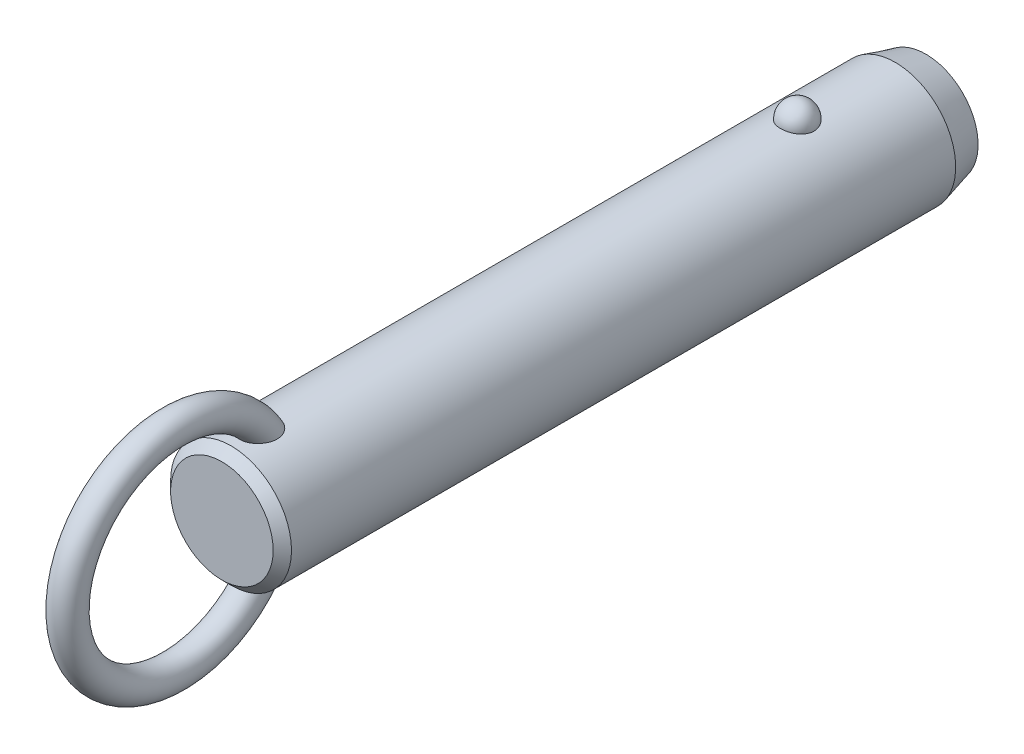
ISO-10303-21;
HEADER;
FILE_DESCRIPTION(('STEP AP214'),'2;1');
FILE_NAME('part.step','',(''),(''),'','','');
FILE_SCHEMA(('AUTOMOTIVE_DESIGN { 1 0 10303 214 1 1 1 1 }'));
ENDSEC;
DATA;
#1=APPLICATION_CONTEXT('core data for automotive mechanical design processes');
#2=APPLICATION_PROTOCOL_DEFINITION('international standard','automotive_design',2000,#1);
#3=PRODUCT_CONTEXT('',#1,'mechanical');
#4=PRODUCT('Part','Part','',(#3));
#5=PRODUCT_RELATED_PRODUCT_CATEGORY('part','',(#4));
#6=PRODUCT_DEFINITION_FORMATION('','',#4);
#7=PRODUCT_DEFINITION_CONTEXT('part definition',#1,'design');
#8=PRODUCT_DEFINITION('design','',#6,#7);
#9=PRODUCT_DEFINITION_SHAPE('','',#8);
#10=(LENGTH_UNIT() NAMED_UNIT(*) SI_UNIT(.MILLI.,.METRE.));
#11=(NAMED_UNIT(*) PLANE_ANGLE_UNIT() SI_UNIT($,.RADIAN.));
#12=(NAMED_UNIT(*) SI_UNIT($,.STERADIAN.) SOLID_ANGLE_UNIT());
#13=UNCERTAINTY_MEASURE_WITH_UNIT(LENGTH_MEASURE(1.E-05),#10,'distance_accuracy_value','');
#14=(GEOMETRIC_REPRESENTATION_CONTEXT(3) GLOBAL_UNCERTAINTY_ASSIGNED_CONTEXT((#13)) GLOBAL_UNIT_ASSIGNED_CONTEXT((#10,
#11,#12)) REPRESENTATION_CONTEXT('',''));
#15=CARTESIAN_POINT('',(0.,0.,0.));
#16=DIRECTION('',(0.,0.,1.));
#17=DIRECTION('',(1.,0.,0.));
#18=AXIS2_PLACEMENT_3D('',#15,#16,#17);
#19=CARTESIAN_POINT('',(0.,0.,63.5));
#20=DIRECTION('',(0.,0.,-1.));
#21=DIRECTION('',(-1.,0.,0.));
#22=AXIS2_PLACEMENT_3D('',#19,#20,#21);
#23=CYLINDRICAL_SURFACE('',#22,7.9);
#24=CARTESIAN_POINT('',(2.1785689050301,7.59367088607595,-2.19999999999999));
#25=CARTESIAN_POINT('',(2.17856679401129,7.59367269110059,-2.07701843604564));
#26=CARTESIAN_POINT('',(2.16853481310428,7.59657145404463,-1.95401006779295));
#27=CARTESIAN_POINT('',(2.12864689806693,7.607843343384,-1.71147811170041));
#28=CARTESIAN_POINT('',(2.09878338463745,7.61621856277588,-1.59195587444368));
#29=CARTESIAN_POINT('',(2.0199931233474,7.63749180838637,-1.3598563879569));
#30=CARTESIAN_POINT('',(1.97107475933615,7.6503878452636,-1.24727610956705));
#31=CARTESIAN_POINT('',(1.85539377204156,7.67926115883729,-1.03213234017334));
#32=CARTESIAN_POINT('',(1.78863158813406,7.69523835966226,-0.929568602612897));
#33=CARTESIAN_POINT('',(1.63856494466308,7.7285848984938,-0.736786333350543));
#34=CARTESIAN_POINT('',(1.55518140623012,7.7459606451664,-0.646630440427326));
#35=CARTESIAN_POINT('',(1.37422937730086,7.78009978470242,-0.481747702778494));
#36=CARTESIAN_POINT('',(1.27666086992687,7.79686317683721,-0.407020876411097));
#37=CARTESIAN_POINT('',(1.07024728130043,7.82786153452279,-0.275278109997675));
#38=CARTESIAN_POINT('',(0.961434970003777,7.84210353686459,-0.218212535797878));
#39=CARTESIAN_POINT('',(0.735351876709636,7.86652194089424,-0.123146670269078));
#40=CARTESIAN_POINT('',(0.618082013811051,7.87669878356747,-0.085144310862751));
#41=CARTESIAN_POINT('',(0.380637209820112,7.89170521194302,-0.0298158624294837));
#42=CARTESIAN_POINT('',(0.260550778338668,7.89662650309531,-0.0121347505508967));
#43=CARTESIAN_POINT('',(0.0190117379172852,7.90090003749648,0.00324379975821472));
#44=CARTESIAN_POINT('',(-0.102440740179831,7.90025280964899,0.00094313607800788));
#45=CARTESIAN_POINT('',(-0.341452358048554,7.89351056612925,-0.0233955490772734));
#46=CARTESIAN_POINT('',(-0.459042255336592,7.88749257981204,-0.0451545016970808));
#47=CARTESIAN_POINT('',(-0.688796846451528,7.87075812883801,-0.107408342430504));
#48=CARTESIAN_POINT('',(-0.800961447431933,7.86004158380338,-0.147903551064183));
#49=CARTESIAN_POINT('',(-1.01743634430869,7.83497131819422,-0.246799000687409));
#50=CARTESIAN_POINT('',(-1.12169791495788,7.82059709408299,-0.305300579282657));
#51=CARTESIAN_POINT('',(-1.31891765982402,7.78976470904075,-0.438549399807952));
#52=CARTESIAN_POINT('',(-1.41187469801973,7.77330633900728,-0.513298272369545));
#53=CARTESIAN_POINT('',(-1.58577142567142,7.73972434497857,-0.678622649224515));
#54=CARTESIAN_POINT('',(-1.66645140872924,7.72259402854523,-0.769470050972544));
#55=CARTESIAN_POINT('',(-1.81161503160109,7.68983776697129,-0.963538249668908));
#56=CARTESIAN_POINT('',(-1.87609753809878,7.6742119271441,-1.06675991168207));
#57=CARTESIAN_POINT('',(-1.98790138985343,7.6460202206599,-1.28401170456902));
#58=CARTESIAN_POINT('',(-2.03501994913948,7.63349104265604,-1.39815107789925));
#59=CARTESIAN_POINT('',(-2.10986724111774,7.6131449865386,-1.63301784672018));
#60=CARTESIAN_POINT('',(-2.1375965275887,7.60532797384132,-1.75374505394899));
#61=CARTESIAN_POINT('',(-2.17289256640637,7.5953195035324,-1.99782562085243));
#62=CARTESIAN_POINT('',(-2.18054294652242,7.59310471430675,-2.12116592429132));
#63=CARTESIAN_POINT('',(-2.17572919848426,7.59448538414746,-2.36741799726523));
#64=CARTESIAN_POINT('',(-2.1632656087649,7.59808068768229,-2.49032977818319));
#65=CARTESIAN_POINT('',(-2.11865035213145,7.61064035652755,-2.73161015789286));
#66=CARTESIAN_POINT('',(-2.08659579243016,7.61957823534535,-2.84999812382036));
#67=CARTESIAN_POINT('',(-2.00367799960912,7.64179982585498,-3.07955956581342));
#68=CARTESIAN_POINT('',(-1.9528140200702,7.65508371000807,-3.19073275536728));
#69=CARTESIAN_POINT('',(-1.83321113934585,7.68460381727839,-3.40337899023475));
#70=CARTESIAN_POINT('',(-1.76437735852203,7.70085556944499,-3.50479651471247));
#71=CARTESIAN_POINT('',(-1.61069526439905,7.73445734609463,-3.69446912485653));
#72=CARTESIAN_POINT('',(-1.52584634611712,7.75180741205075,-3.78272371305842));
#73=CARTESIAN_POINT('',(-1.34198059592,7.78574608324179,-3.94393987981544));
#74=CARTESIAN_POINT('',(-1.24291308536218,7.80233167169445,-4.01684434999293));
#75=CARTESIAN_POINT('',(-1.03352039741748,7.83281625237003,-4.14489386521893));
#76=CARTESIAN_POINT('',(-0.92319600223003,7.84671543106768,-4.20004014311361));
#77=CARTESIAN_POINT('',(-0.695822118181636,7.87011575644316,-4.29042017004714));
#78=CARTESIAN_POINT('',(-0.578872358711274,7.87966903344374,-4.32589112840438));
#79=CARTESIAN_POINT('',(-0.340410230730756,7.8935652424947,-4.37692226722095));
#80=CARTESIAN_POINT('',(-0.218898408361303,7.89790879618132,-4.39248482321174));
#81=CARTESIAN_POINT('',(0.0228107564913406,7.90087453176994,-4.40314405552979));
#82=CARTESIAN_POINT('',(0.142990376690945,7.89960185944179,-4.39861683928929));
#83=CARTESIAN_POINT('',(0.380829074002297,7.89171262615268,-4.37008293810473));
#84=CARTESIAN_POINT('',(0.498488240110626,7.8850962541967,-4.34607694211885));
#85=CARTESIAN_POINT('',(0.727535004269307,7.86726442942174,-4.27939317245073));
#86=CARTESIAN_POINT('',(0.838944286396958,7.85606616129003,-4.236785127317));
#87=CARTESIAN_POINT('',(1.05295421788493,7.83025654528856,-4.13408348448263));
#88=CARTESIAN_POINT('',(1.15555431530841,7.81564498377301,-4.07398879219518));
#89=CARTESIAN_POINT('',(1.35076763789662,7.7843022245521,-3.93687432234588));
#90=CARTESIAN_POINT('',(1.4432046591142,7.76754209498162,-3.85961036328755));
#91=CARTESIAN_POINT('',(1.6139111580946,7.73387857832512,-3.69076949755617));
#92=CARTESIAN_POINT('',(1.6921781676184,7.71697516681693,-3.59919010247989));
#93=CARTESIAN_POINT('',(1.83380875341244,7.6845643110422,-3.40247278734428));
#94=CARTESIAN_POINT('',(1.89689280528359,7.66908588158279,-3.29712873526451));
#95=CARTESIAN_POINT('',(2.0047823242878,7.64159441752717,-3.07707931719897));
#96=CARTESIAN_POINT('',(2.0495945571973,7.62958010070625,-2.96237743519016));
#97=CARTESIAN_POINT('',(2.11580183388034,7.61146617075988,-2.74040519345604));
#98=CARTESIAN_POINT('',(2.13929812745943,7.60484503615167,-2.63379846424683));
#99=CARTESIAN_POINT('',(2.17068242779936,7.59594664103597,-2.41813481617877));
#100=CARTESIAN_POINT('',(2.17857077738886,7.59366928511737,-2.30907795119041));
#101=CARTESIAN_POINT('',(2.1785689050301,7.59367088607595,-2.19999999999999));
#102=B_SPLINE_CURVE_WITH_KNOTS('',3,(#24,#25,#26,#27,#28,#29,#30,#31,#32,#33,#34,#35,#36,#37,
#38,#39,#40,#41,#42,#43,#44,#45,#46,#47,#48,#49,#50,#51,#52,#53,#54,#55,#56,#57,#58,#59,#60,#61,
#62,#63,#64,#65,#66,#67,#68,#69,#70,#71,#72,#73,#74,#75,#76,#77,#78,#79,#80,#81,#82,#83,#84,#85,
#86,#87,#88,#89,#90,#91,#92,#93,#94,#95,#96,#97,#98,#99,#100,#101),.UNSPECIFIED.,.T.,.F.,(4,2,2,
2,2,2,2,2,2,2,2,2,2,2,2,2,2,2,2,2,2,2,2,2,2,2,2,2,2,2,2,2,2,2,2,2,2,2,4),(0.,0.368552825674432,
0.737246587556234,1.10577831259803,1.4743009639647,1.8446206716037,2.21494081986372,
2.5842105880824,2.95344028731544,3.31611630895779,3.67875788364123,4.03628044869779,
4.39380913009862,4.75338791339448,5.11300280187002,5.47939989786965,5.8458226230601,
6.21639834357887,6.58696347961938,6.95598276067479,7.32499216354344,7.69218715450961,
8.0593967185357,8.42858578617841,8.79778880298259,9.16834203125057,9.5388695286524,
9.90482699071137,10.2707407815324,10.6298333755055,10.9889132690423,11.3466585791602,
11.7044262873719,12.0676511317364,12.4309391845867,12.8004764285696,13.1698767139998,
13.4967701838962,13.8236564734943),.UNSPECIFIED.);
#103=CARTESIAN_POINT('',(2.1785689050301,7.59367088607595,-2.19999999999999));
#104=VERTEX_POINT('',#103);
#105=EDGE_CURVE('E41',#104,#104,#102,.T.);
#106=ORIENTED_EDGE('',*,*,#105,.T.);
#107=EDGE_LOOP('',(#106));
#108=FACE_BOUND('',#107,.T.);
#109=CARTESIAN_POINT('',(0.,0.,71.82));
#110=DIRECTION('',(0.,0.,1.));
#111=DIRECTION('',(1.,0.,0.));
#112=AXIS2_PLACEMENT_3D('',#109,#110,#111);
#113=CIRCLE('',#112,7.9);
#114=CARTESIAN_POINT('',(7.9,0.,71.82));
#115=VERTEX_POINT('',#114);
#116=EDGE_CURVE('E10',#115,#115,#113,.F.);
#117=ORIENTED_EDGE('',*,*,#116,.T.);
#118=EDGE_LOOP('',(#117));
#119=FACE_BOUND('',#118,.T.);
#120=CARTESIAN_POINT('',(-0.630969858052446,-7.87476203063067,65.7124322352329));
#121=CARTESIAN_POINT('',(-0.73418033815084,-7.8664899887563,65.747285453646));
#122=CARTESIAN_POINT('',(-0.834476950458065,-7.85639291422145,65.7908160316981));
#123=CARTESIAN_POINT('',(-1.02620356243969,-7.83366343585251,65.8940948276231));
#124=CARTESIAN_POINT('',(-1.1176141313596,-7.82102565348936,65.9538775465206));
#125=CARTESIAN_POINT('',(-1.28877277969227,-7.79464922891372,66.0878390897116));
#126=CARTESIAN_POINT('',(-1.36854014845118,-7.78091246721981,66.161993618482));
#127=CARTESIAN_POINT('',(-1.5146152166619,-7.75380398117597,66.3224941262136));
#128=CARTESIAN_POINT('',(-1.58092966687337,-7.74043207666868,66.4088339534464));
#129=CARTESIAN_POINT('',(-1.70019064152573,-7.71512522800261,66.5929784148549));
#130=CARTESIAN_POINT('',(-1.75284037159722,-7.70322473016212,66.6909792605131));
#131=CARTESIAN_POINT('',(-1.84263464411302,-7.68224112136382,66.8941029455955));
#132=CARTESIAN_POINT('',(-1.87977299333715,-7.6731591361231,66.9992286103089));
#133=CARTESIAN_POINT('',(-1.94152728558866,-7.65777930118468,67.2232849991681));
#134=CARTESIAN_POINT('',(-1.96475471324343,-7.65179654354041,67.3426167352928));
#135=CARTESIAN_POINT('',(-1.99449499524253,-7.64409642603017,67.5834298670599));
#136=CARTESIAN_POINT('',(-2.0010005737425,-7.64238092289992,67.7049121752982));
#137=CARTESIAN_POINT('',(-1.99856014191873,-7.64302120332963,67.9683409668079));
#138=CARTESIAN_POINT('',(-1.98680021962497,-7.64611845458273,68.1102565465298));
#139=CARTESIAN_POINT('',(-1.9445777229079,-7.65696186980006,68.3911188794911));
#140=CARTESIAN_POINT('',(-1.91409393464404,-7.66471330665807,68.5300620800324));
#141=CARTESIAN_POINT('',(-1.82768670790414,-7.68582947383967,68.831939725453));
#142=CARTESIAN_POINT('',(-1.76772963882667,-7.70003779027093,68.993686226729));
#143=CARTESIAN_POINT('',(-1.65998501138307,-7.72371550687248,69.2276956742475));
#144=CARTESIAN_POINT('',(-1.621079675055,-7.73200670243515,69.3042974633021));
#145=CARTESIAN_POINT('',(-1.53727726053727,-7.74910377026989,69.4540798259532));
#146=CARTESIAN_POINT('',(-1.49238215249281,-7.75790947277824,69.5272615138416));
#147=CARTESIAN_POINT('',(-1.3739705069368,-7.77993338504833,69.7028838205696));
#148=CARTESIAN_POINT('',(-1.29690364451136,-7.79328473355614,69.8029557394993));
#149=CARTESIAN_POINT('',(-1.1288548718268,-7.81939266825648,69.9907147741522));
#150=CARTESIAN_POINT('',(-1.03789926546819,-7.83215032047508,70.0784247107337));
#151=CARTESIAN_POINT('',(-0.869532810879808,-7.85231710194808,70.2134148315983));
#152=CARTESIAN_POINT('',(-0.795716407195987,-7.86021093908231,70.265076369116));
#153=CARTESIAN_POINT('',(-0.640813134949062,-7.87434920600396,70.3563815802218));
#154=CARTESIAN_POINT('',(-0.559737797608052,-7.88059619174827,70.3960438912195));
#155=CARTESIAN_POINT('',(-0.406456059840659,-7.88984116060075,70.4543008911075));
#156=CARTESIAN_POINT('',(-0.335227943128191,-7.89321892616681,70.4753848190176));
#157=CARTESIAN_POINT('',(-0.19019307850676,-7.89804235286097,70.5054141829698));
#158=CARTESIAN_POINT('',(-0.11638863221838,-7.89948969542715,70.5143701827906));
#159=CARTESIAN_POINT('',(0.0318414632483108,-7.90028409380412,70.5192915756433));
#160=CARTESIAN_POINT('',(0.106268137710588,-7.89962640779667,70.5152276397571));
#161=CARTESIAN_POINT('',(0.253290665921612,-7.8962818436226,70.4944615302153));
#162=CARTESIAN_POINT('',(0.32588518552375,-7.8935935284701,70.4777504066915));
#163=CARTESIAN_POINT('',(0.481441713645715,-7.88577340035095,70.4287380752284));
#164=CARTESIAN_POINT('',(0.563611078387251,-7.88026321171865,70.394005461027));
#165=CARTESIAN_POINT('',(0.721129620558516,-7.86741729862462,70.3117965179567));
#166=CARTESIAN_POINT('',(0.796466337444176,-7.86007832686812,70.2642975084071));
#167=CARTESIAN_POINT('',(0.971456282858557,-7.84073285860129,70.136513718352));
#168=CARTESIAN_POINT('',(1.0671968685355,-7.82809461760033,70.0510047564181));
#169=CARTESIAN_POINT('',(1.24418921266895,-7.80192439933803,69.866232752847));
#170=CARTESIAN_POINT('',(1.32540832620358,-7.78839049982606,69.7669395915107));
#171=CARTESIAN_POINT('',(1.45199971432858,-7.76559693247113,69.5895760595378));
#172=CARTESIAN_POINT('',(1.50085649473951,-7.75626094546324,69.5139542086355));
#173=CARTESIAN_POINT('',(1.59197749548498,-7.7380727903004,69.3587428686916));
#174=CARTESIAN_POINT('',(1.63423919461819,-7.72922080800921,69.2791518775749));
#175=CARTESIAN_POINT('',(1.71222612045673,-7.71231959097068,69.1166640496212));
#176=CARTESIAN_POINT('',(1.74794516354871,-7.70427111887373,69.0337641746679));
#177=CARTESIAN_POINT('',(1.81270113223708,-7.68929240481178,68.8652967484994));
#178=CARTESIAN_POINT('',(1.84173789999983,-7.68236218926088,68.7797291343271));
#179=CARTESIAN_POINT('',(1.89322698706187,-7.66983757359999,68.6052870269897));
#180=CARTESIAN_POINT('',(1.91558744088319,-7.66426199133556,68.5163838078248));
#181=CARTESIAN_POINT('',(1.95281367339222,-7.65485915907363,68.3369696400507));
#182=CARTESIAN_POINT('',(1.96767946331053,-7.65103190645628,68.2464586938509));
#183=CARTESIAN_POINT('',(2.00021456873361,-7.64262981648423,67.9737320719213));
#184=CARTESIAN_POINT('',(2.00600691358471,-7.6410871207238,67.7897099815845));
#185=CARTESIAN_POINT('',(1.98445334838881,-7.64669564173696,67.4765019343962));
#186=CARTESIAN_POINT('',(1.96607186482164,-7.65149688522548,67.3466189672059));
#187=CARTESIAN_POINT('',(1.90884967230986,-7.6659762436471,67.0916321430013));
#188=CARTESIAN_POINT('',(1.8700210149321,-7.67565148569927,66.966525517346));
#189=CARTESIAN_POINT('',(1.77063986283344,-7.69918471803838,66.7245401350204));
#190=CARTESIAN_POINT('',(1.70993724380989,-7.71307150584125,66.6077250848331));
#191=CARTESIAN_POINT('',(1.5673307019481,-7.74330306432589,66.3881444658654));
#192=CARTESIAN_POINT('',(1.48543692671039,-7.75964665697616,66.2853722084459));
#193=CARTESIAN_POINT('',(1.31346177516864,-7.79047523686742,66.1093800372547));
#194=CARTESIAN_POINT('',(1.22547278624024,-7.80495298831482,66.0341066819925));
#195=CARTESIAN_POINT('',(1.03724352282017,-7.83218597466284,65.9004864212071));
#196=CARTESIAN_POINT('',(0.937008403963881,-7.84494192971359,65.8421324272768));
#197=CARTESIAN_POINT('',(0.733599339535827,-7.86649045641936,65.7470270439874));
#198=CARTESIAN_POINT('',(0.630941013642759,-7.87547134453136,65.7092109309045));
#199=CARTESIAN_POINT('',(0.420465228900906,-7.88950708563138,65.6511160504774));
#200=CARTESIAN_POINT('',(0.312645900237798,-7.89456050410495,65.6308436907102));
#201=CARTESIAN_POINT('',(0.0960869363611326,-7.9001518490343,65.6084559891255));
#202=CARTESIAN_POINT('',(-0.0126341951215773,-7.90073226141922,65.6061698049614));
#203=CARTESIAN_POINT('',(-0.228766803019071,-7.89742350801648,65.6193678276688));
#204=CARTESIAN_POINT('',(-0.336180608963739,-7.89354403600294,65.6348134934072));
#205=CARTESIAN_POINT('',(-0.473410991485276,-7.88586871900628,65.6662177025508));
#206=CARTESIAN_POINT('',(-0.50525779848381,-7.88388984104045,65.6743541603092));
#207=CARTESIAN_POINT('',(-0.5684812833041,-7.87958326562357,65.6922083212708));
#208=CARTESIAN_POINT('',(-0.599857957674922,-7.87725556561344,65.7019260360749));
#209=CARTESIAN_POINT('',(-0.630969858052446,-7.87476203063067,65.7124322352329));
#210=B_SPLINE_CURVE_WITH_KNOTS('',3,(#120,#121,#122,#123,#124,#125,#126,#127,#128,#129,#130,
#131,#132,#133,#134,#135,#136,#137,#138,#139,#140,#141,#142,#143,#144,#145,#146,#147,#148,#149,
#150,#151,#152,#153,#154,#155,#156,#157,#158,#159,#160,#161,#162,#163,#164,#165,#166,#167,#168,
#169,#170,#171,#172,#173,#174,#175,#176,#177,#178,#179,#180,#181,#182,#183,#184,#185,#186,#187,
#188,#189,#190,#191,#192,#193,#194,#195,#196,#197,#198,#199,#200,#201,#202,#203,#204,#205,#206,
#207,#208,#209),.UNSPECIFIED.,.T.,.F.,(4,2,2,2,2,2,2,2,2,2,2,2,2,2,2,2,2,2,2,2,2,2,2,2,2,2,2,2,
2,2,2,2,2,2,2,2,2,2,2,2,2,2,2,2,4),(0.,0.327622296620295,0.655945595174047,0.983718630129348,
1.3113267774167,1.64554655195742,1.9798996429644,2.3436572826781,2.70757317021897,
3.13333684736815,3.55958380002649,4.07655306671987,4.3352789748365,4.59391999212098,
4.97382437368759,5.35301797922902,5.62348245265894,5.89352465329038,6.11565959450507,
6.3376009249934,6.56004255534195,6.78264174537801,7.04930844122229,7.31645206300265,
7.70130871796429,8.08701995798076,8.35824509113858,8.62957365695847,8.90115735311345,
9.17274746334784,9.44791855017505,9.72308922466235,10.2715298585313,10.6638393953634,
11.0559179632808,11.4507403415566,11.845374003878,12.1936425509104,12.5417649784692,
12.8695063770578,13.1973674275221,13.5221104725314,13.8461490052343,13.9449071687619,
14.0436660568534),.UNSPECIFIED.);
#211=CARTESIAN_POINT('',(-0.630969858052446,-7.87476203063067,65.7124322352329));
#212=VERTEX_POINT('',#211);
#213=EDGE_CURVE('E60',#212,#212,#210,.T.);
#214=ORIENTED_EDGE('',*,*,#213,.T.);
#215=EDGE_LOOP('',(#214));
#216=FACE_BOUND('',#215,.T.);
#217=CARTESIAN_POINT('',(-0.630969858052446,7.87476203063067,65.7124322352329));
#218=CARTESIAN_POINT('',(-0.528918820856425,7.88293636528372,65.6779798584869));
#219=CARTESIAN_POINT('',(-0.423745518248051,7.8893481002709,65.651915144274));
#220=CARTESIAN_POINT('',(-0.210236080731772,7.8979273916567,65.6172825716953));
#221=CARTESIAN_POINT('',(-0.10189380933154,7.90008607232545,65.6087513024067));
#222=CARTESIAN_POINT('',(0.114660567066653,7.89990877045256,65.6094570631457));
#223=CARTESIAN_POINT('',(0.222872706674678,7.89757640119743,65.6186798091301));
#224=CARTESIAN_POINT('',(0.436107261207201,7.88867538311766,65.6546525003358));
#225=CARTESIAN_POINT('',(0.541131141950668,7.8821087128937,65.6813942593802));
#226=CARTESIAN_POINT('',(0.745085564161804,7.86545130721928,65.7517561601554));
#227=CARTESIAN_POINT('',(0.844015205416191,7.85536005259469,65.7953787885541));
#228=CARTESIAN_POINT('',(1.03299167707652,7.83275153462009,65.8983796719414));
#229=CARTESIAN_POINT('',(1.12303841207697,7.8202342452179,65.9577580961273));
#230=CARTESIAN_POINT('',(1.29214734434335,7.79408219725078,66.0908647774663));
#231=CARTESIAN_POINT('',(1.37116907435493,7.78044359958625,66.1646436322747));
#232=CARTESIAN_POINT('',(1.51597677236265,7.75353170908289,66.3242353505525));
#233=CARTESIAN_POINT('',(1.58176261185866,7.74025841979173,66.4100483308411));
#234=CARTESIAN_POINT('',(1.70057386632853,7.71504069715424,66.593644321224));
#235=CARTESIAN_POINT('',(1.75320073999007,7.70314257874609,66.6916906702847));
#236=CARTESIAN_POINT('',(1.84293767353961,7.68216822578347,66.8948931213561));
#237=CARTESIAN_POINT('',(1.88004278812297,7.67309289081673,67.0000514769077));
#238=CARTESIAN_POINT('',(1.9417232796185,7.6577294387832,67.2241671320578));
#239=CARTESIAN_POINT('',(1.96491037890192,7.65175648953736,67.3435248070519));
#240=CARTESIAN_POINT('',(1.9945689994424,7.64407702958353,67.5843848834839));
#241=CARTESIAN_POINT('',(2.00103304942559,7.64237242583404,67.7058882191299));
#242=CARTESIAN_POINT('',(1.9985016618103,7.64303650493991,67.9693688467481));
#243=CARTESIAN_POINT('',(1.98669038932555,7.64614714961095,68.1113141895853));
#244=CARTESIAN_POINT('',(1.94436120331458,7.6570170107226,68.3922287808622));
#245=CARTESIAN_POINT('',(1.91382203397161,7.66478150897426,68.5311944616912));
#246=CARTESIAN_POINT('',(1.82728754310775,7.68592483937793,68.8331110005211));
#247=CARTESIAN_POINT('',(1.76725778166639,7.7001468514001,68.994872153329));
#248=CARTESIAN_POINT('',(1.65939700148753,7.72384204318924,69.2288914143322));
#249=CARTESIAN_POINT('',(1.62045187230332,7.73213852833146,69.3054942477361));
#250=CARTESIAN_POINT('',(1.53656684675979,7.74924489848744,69.4552737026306));
#251=CARTESIAN_POINT('',(1.49162892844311,7.75805461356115,69.5284514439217));
#252=CARTESIAN_POINT('',(1.37317698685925,7.78007342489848,69.7039520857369));
#253=CARTESIAN_POINT('',(1.29612360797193,7.79341423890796,69.8039112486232));
#254=CARTESIAN_POINT('',(1.12812043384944,7.81949839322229,69.9914508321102));
#255=CARTESIAN_POINT('',(1.03719688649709,7.83224280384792,70.0790540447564));
#256=CARTESIAN_POINT('',(0.868871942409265,7.85239026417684,70.2138971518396));
#257=CARTESIAN_POINT('',(0.795056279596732,7.86027769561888,70.2655113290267));
#258=CARTESIAN_POINT('',(0.640160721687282,7.87440222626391,70.3567201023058));
#259=CARTESIAN_POINT('',(0.559092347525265,7.88064188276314,70.3963333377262));
#260=CARTESIAN_POINT('',(0.405820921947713,7.8898738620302,70.4545056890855));
#261=CARTESIAN_POINT('',(0.334594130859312,7.89324577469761,70.4755523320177));
#262=CARTESIAN_POINT('',(0.189568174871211,7.89805733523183,70.5055070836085));
#263=CARTESIAN_POINT('',(0.115771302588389,7.89949866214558,70.5144257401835));
#264=CARTESIAN_POINT('',(-0.032435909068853,7.90028156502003,70.5192758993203));
#265=CARTESIAN_POINT('',(-0.106847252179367,7.89961843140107,70.5151782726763));
#266=CARTESIAN_POINT('',(-0.253834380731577,7.8962642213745,70.4943519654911));
#267=CARTESIAN_POINT('',(-0.326408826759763,7.89357170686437,70.4776143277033));
#268=CARTESIAN_POINT('',(-0.481962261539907,7.88574179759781,70.4285391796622));
#269=CARTESIAN_POINT('',(-0.564145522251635,7.88022507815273,70.3937638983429));
#270=CARTESIAN_POINT('',(-0.72168526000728,7.8673664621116,70.3114686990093));
#271=CARTESIAN_POINT('',(-0.797029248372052,7.8600213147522,70.2639260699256));
#272=CARTESIAN_POINT('',(-0.972044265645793,7.84066026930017,70.1360267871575));
#273=CARTESIAN_POINT('',(-1.06779803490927,7.82801274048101,70.0504436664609));
#274=CARTESIAN_POINT('',(-1.24480531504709,7.80182621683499,69.8655223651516));
#275=CARTESIAN_POINT('',(-1.32602618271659,7.78828530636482,69.7661540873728));
#276=CARTESIAN_POINT('',(-1.45259834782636,7.76548487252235,69.5886806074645));
#277=CARTESIAN_POINT('',(-1.50143856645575,7.75614818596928,69.5130252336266));
#278=CARTESIAN_POINT('',(-1.59252410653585,7.73796020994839,69.3577484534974));
#279=CARTESIAN_POINT('',(-1.63476690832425,7.72910910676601,69.2781255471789));
#280=CARTESIAN_POINT('',(-1.71271318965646,7.71221133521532,69.1155750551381));
#281=CARTESIAN_POINT('',(-1.74841047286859,7.70416543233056,69.0326444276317));
#282=CARTESIAN_POINT('',(-1.81311929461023,7.6891937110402,68.8641168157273));
#283=CARTESIAN_POINT('',(-1.84213067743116,7.6822679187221,68.7785197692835));
#284=CARTESIAN_POINT('',(-1.89356259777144,7.66975461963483,68.6040254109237));
#285=CARTESIAN_POINT('',(-1.91589165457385,7.66418586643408,68.5150995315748));
#286=CARTESIAN_POINT('',(-1.95305070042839,7.65479859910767,68.3356424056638));
#287=CARTESIAN_POINT('',(-1.96788069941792,7.65098008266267,68.2451111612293));
#288=CARTESIAN_POINT('',(-2.00030078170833,7.64260704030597,67.9723270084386));
#289=CARTESIAN_POINT('',(-2.00600576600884,7.64108760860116,67.7882718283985));
#290=CARTESIAN_POINT('',(-1.98428483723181,7.64673945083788,67.4750800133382));
#291=CARTESIAN_POINT('',(-1.96583698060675,7.6515575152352,67.3452400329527));
#292=CARTESIAN_POINT('',(-1.90848948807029,7.66606613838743,67.0903619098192));
#293=CARTESIAN_POINT('',(-1.86960376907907,7.67575338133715,66.965320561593));
#294=CARTESIAN_POINT('',(-1.7701342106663,7.69930132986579,66.7235009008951));
#295=CARTESIAN_POINT('',(-1.70940488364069,7.71318991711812,66.6067844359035));
#296=CARTESIAN_POINT('',(-1.56672953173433,7.74342495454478,66.3873404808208));
#297=CARTESIAN_POINT('',(-1.48478316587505,7.75977144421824,66.2846132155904));
#298=CARTESIAN_POINT('',(-1.31266325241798,7.79061163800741,66.1086431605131));
#299=CARTESIAN_POINT('',(-1.22456383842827,7.80509908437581,66.0333589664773));
#300=CARTESIAN_POINT('',(-1.03622400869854,7.83231881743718,65.8998659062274));
#301=CARTESIAN_POINT('',(-0.936015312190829,7.84505551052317,65.8416137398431));
#302=CARTESIAN_POINT('',(-0.798824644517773,7.85957802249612,65.7775408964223));
#303=CARTESIAN_POINT('',(-0.765787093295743,7.86286821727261,65.7632248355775));
#304=CARTESIAN_POINT('',(-0.698939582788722,7.86909211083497,65.736436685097));
#305=CARTESIAN_POINT('',(-0.66512963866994,7.8720258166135,65.7239645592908));
#306=CARTESIAN_POINT('',(-0.630969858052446,7.87476203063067,65.7124322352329));
#307=B_SPLINE_CURVE_WITH_KNOTS('',3,(#217,#218,#219,#220,#221,#222,#223,#224,#225,#226,#227,
#228,#229,#230,#231,#232,#233,#234,#235,#236,#237,#238,#239,#240,#241,#242,#243,#244,#245,#246,
#247,#248,#249,#250,#251,#252,#253,#254,#255,#256,#257,#258,#259,#260,#261,#262,#263,#264,#265,
#266,#267,#268,#269,#270,#271,#272,#273,#274,#275,#276,#277,#278,#279,#280,#281,#282,#283,#284,
#285,#286,#287,#288,#289,#290,#291,#292,#293,#294,#295,#296,#297,#298,#299,#300,#301,#302,#303,
#304,#305,#306),.UNSPECIFIED.,.T.,.F.,(4,2,2,2,2,2,2,2,2,2,2,2,2,2,2,2,2,2,2,2,2,2,2,2,2,2,2,2,
2,2,2,2,2,2,2,2,2,2,2,2,2,2,2,2,4),(0.,0.323920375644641,0.648516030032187,0.97285063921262,
1.29703380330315,1.62126473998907,1.94549915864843,2.27089401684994,2.5962920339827,
2.93059633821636,3.26500707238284,3.62881644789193,3.99278833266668,4.41865421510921,
4.84500434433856,5.36209210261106,5.62087589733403,5.87957448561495,6.25918598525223,
6.63808782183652,6.90846748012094,7.17842501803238,7.40052350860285,7.62242871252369,
7.84483086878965,8.06739077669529,8.33414615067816,8.60137921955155,8.98641454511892,
9.3723041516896,9.64358673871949,9.91497268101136,10.1866142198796,10.4582620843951,
10.7334745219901,11.0086865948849,11.5572126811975,11.9494246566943,12.3413699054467,
12.7359755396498,13.1305875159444,13.4791770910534,13.82687259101,13.9353013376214,
14.0437279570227),.UNSPECIFIED.);
#308=CARTESIAN_POINT('',(-0.630969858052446,7.87476203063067,65.7124322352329));
#309=VERTEX_POINT('',#308);
#310=EDGE_CURVE('E68',#309,#309,#307,.T.);
#311=ORIENTED_EDGE('',*,*,#310,.T.);
#312=EDGE_LOOP('',(#311));
#313=FACE_BOUND('',#312,.T.);
#314=CARTESIAN_POINT('',(0.,0.,-14.9999999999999));
#315=DIRECTION('',(0.,0.,-1.));
#316=DIRECTION('',(-1.,0.,0.));
#317=AXIS2_PLACEMENT_3D('',#314,#315,#316);
#318=CIRCLE('',#317,7.9);
#319=CARTESIAN_POINT('',(-7.9,0.,-14.9999999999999));
#320=VERTEX_POINT('',#319);
#321=EDGE_CURVE('E57',#320,#320,#318,.F.);
#322=ORIENTED_EDGE('',*,*,#321,.T.);
#323=EDGE_LOOP('',(#322));
#324=FACE_BOUND('',#323,.T.);
#325=ADVANCED_FACE('F37',(#108,#119,#216,#313,#324),#23,.T.);
#326=CARTESIAN_POINT('',(0.,0.,-19.));
#327=DIRECTION('',(0.,0.,-1.));
#328=DIRECTION('',(-1.,0.,0.));
#329=AXIS2_PLACEMENT_3D('',#326,#327,#328);
#330=PLANE('',#329);
#331=CARTESIAN_POINT('',(0.,0.,-19.));
#332=DIRECTION('',(0.,0.,-1.));
#333=DIRECTION('',(-1.,0.,0.));
#334=AXIS2_PLACEMENT_3D('',#331,#332,#333);
#335=CIRCLE('',#334,6.8282032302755);
#336=CARTESIAN_POINT('',(-6.8282032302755,0.,-19.));
#337=VERTEX_POINT('',#336);
#338=EDGE_CURVE('E67',#337,#337,#335,.T.);
#339=ORIENTED_EDGE('',*,*,#338,.T.);
#340=EDGE_LOOP('',(#339));
#341=FACE_BOUND('',#340,.T.);
#342=ADVANCED_FACE('F86',(#341),#330,.T.);
#343=CARTESIAN_POINT('',(0.,0.,-19.));
#344=DIRECTION('',(0.,0.,1.));
#345=DIRECTION('',(1.,0.,0.));
#346=AXIS2_PLACEMENT_3D('',#343,#344,#345);
#347=CONICAL_SURFACE('',#346,6.8282032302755,0.261799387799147);
#348=ORIENTED_EDGE('',*,*,#321,.F.);
#349=EDGE_LOOP('',(#348));
#350=FACE_BOUND('',#349,.T.);
#351=ORIENTED_EDGE('',*,*,#338,.F.);
#352=EDGE_LOOP('',(#351));
#353=FACE_BOUND('',#352,.T.);
#354=ADVANCED_FACE('F84',(#350,#353),#347,.T.);
#355=CARTESIAN_POINT('',(0.,0.,73.02));
#356=DIRECTION('',(0.,0.,1.));
#357=DIRECTION('',(1.,0.,0.));
#358=AXIS2_PLACEMENT_3D('',#355,#356,#357);
#359=PLANE('',#358);
#360=CARTESIAN_POINT('',(0.,0.,73.02));
#361=DIRECTION('',(0.,0.,1.));
#362=DIRECTION('',(1.,0.,0.));
#363=AXIS2_PLACEMENT_3D('',#360,#361,#362);
#364=CIRCLE('',#363,6.70000000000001);
#365=CARTESIAN_POINT('',(6.70000000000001,0.,73.02));
#366=VERTEX_POINT('',#365);
#367=EDGE_CURVE('E50',#366,#366,#364,.T.);
#368=ORIENTED_EDGE('',*,*,#367,.T.);
#369=EDGE_LOOP('',(#368));
#370=FACE_BOUND('',#369,.T.);
#371=ADVANCED_FACE('F78',(#370),#359,.T.);
#372=CARTESIAN_POINT('',(0.,0.,79.35));
#373=DIRECTION('',(1.,0.,0.));
#374=DIRECTION('',(0.,0.,-1.));
#375=AXIS2_PLACEMENT_3D('',#372,#373,#374);
#376=TOROIDAL_SURFACE('',#375,13.85,2.);
#377=ORIENTED_EDGE('',*,*,#310,.F.);
#378=EDGE_LOOP('',(#377));
#379=FACE_BOUND('',#378,.T.);
#380=ORIENTED_EDGE('',*,*,#213,.F.);
#381=EDGE_LOOP('',(#380));
#382=FACE_BOUND('',#381,.T.);
#383=ADVANCED_FACE('F74',(#379,#382),#376,.T.);
#384=CARTESIAN_POINT('',(0.,0.,73.02));
#385=DIRECTION('',(0.,0.,-1.));
#386=DIRECTION('',(-1.,0.,0.));
#387=AXIS2_PLACEMENT_3D('',#384,#385,#386);
#388=CONICAL_SURFACE('',#387,6.70000000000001,0.785398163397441);
#389=ORIENTED_EDGE('',*,*,#116,.F.);
#390=EDGE_LOOP('',(#389));
#391=FACE_BOUND('',#390,.T.);
#392=ORIENTED_EDGE('',*,*,#367,.F.);
#393=EDGE_LOOP('',(#392));
#394=FACE_BOUND('',#393,.T.);
#395=ADVANCED_FACE('F39',(#391,#394),#388,.T.);
#396=CARTESIAN_POINT('',(0.,7.9,-2.19999999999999));
#397=DIRECTION('',(0.,1.,0.));
#398=DIRECTION('',(0.,0.,-1.));
#399=AXIS2_PLACEMENT_3D('',#396,#397,#398);
#400=SPHERICAL_SURFACE('',#399,2.2);
#401=ORIENTED_EDGE('',*,*,#105,.F.);
#402=EDGE_LOOP('',(#401));
#403=FACE_BOUND('',#402,.T.);
#404=ADVANCED_FACE('F80',(#403),#400,.T.);
#405=CLOSED_SHELL('',(#325,#342,#354,#371,#383,#395,#404));
#406=MANIFOLD_SOLID_BREP('B2',#405);
#407=ADVANCED_BREP_SHAPE_REPRESENTATION('',(#18,#406),#14);
#408=SHAPE_DEFINITION_REPRESENTATION(#9,#407);
ENDSEC;
END-ISO-10303-21;
